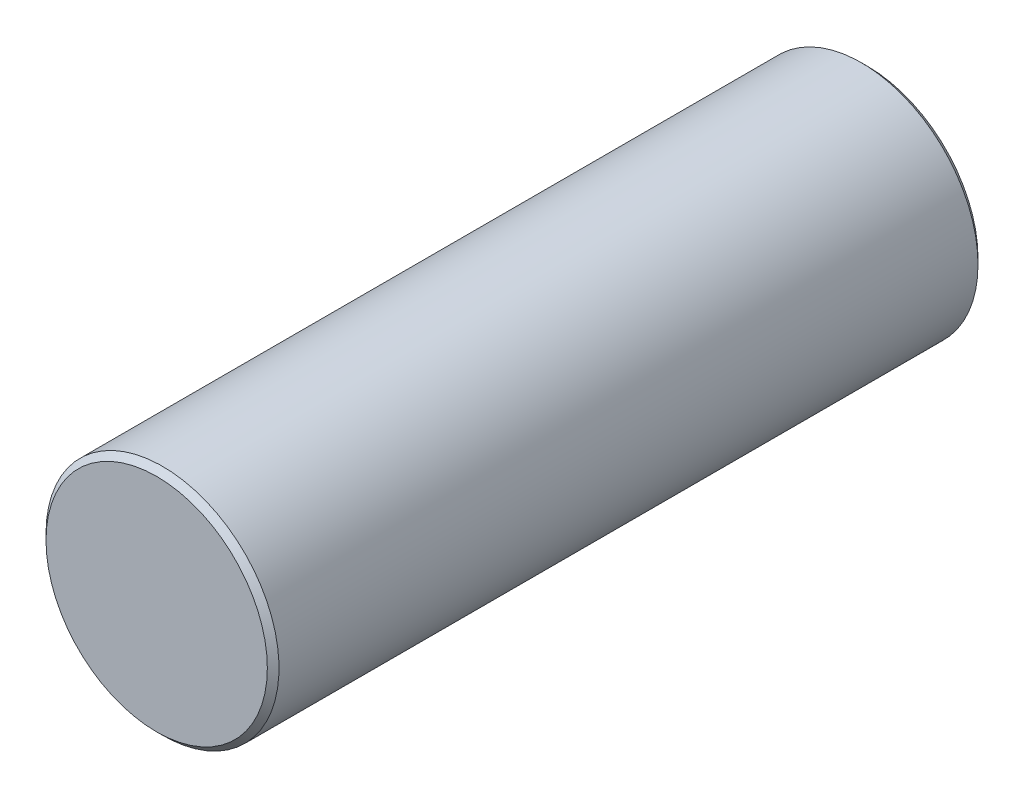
ISO-10303-21;
HEADER;
FILE_DESCRIPTION(('STEP AP214'),'2;1');
FILE_NAME('part.step','',(''),(''),'','','');
FILE_SCHEMA(('AUTOMOTIVE_DESIGN { 1 0 10303 214 1 1 1 1 }'));
ENDSEC;
DATA;
#1=APPLICATION_CONTEXT('core data for automotive mechanical design processes');
#2=APPLICATION_PROTOCOL_DEFINITION('international standard','automotive_design',2000,#1);
#3=PRODUCT_CONTEXT('',#1,'mechanical');
#4=PRODUCT('Part','Part','',(#3));
#5=PRODUCT_RELATED_PRODUCT_CATEGORY('part','',(#4));
#6=PRODUCT_DEFINITION_FORMATION('','',#4);
#7=PRODUCT_DEFINITION_CONTEXT('part definition',#1,'design');
#8=PRODUCT_DEFINITION('design','',#6,#7);
#9=PRODUCT_DEFINITION_SHAPE('','',#8);
#10=(LENGTH_UNIT() NAMED_UNIT(*) SI_UNIT(.MILLI.,.METRE.));
#11=(NAMED_UNIT(*) PLANE_ANGLE_UNIT() SI_UNIT($,.RADIAN.));
#12=(NAMED_UNIT(*) SI_UNIT($,.STERADIAN.) SOLID_ANGLE_UNIT());
#13=UNCERTAINTY_MEASURE_WITH_UNIT(LENGTH_MEASURE(1.E-05),#10,'distance_accuracy_value','');
#14=(GEOMETRIC_REPRESENTATION_CONTEXT(3) GLOBAL_UNCERTAINTY_ASSIGNED_CONTEXT((#13)) GLOBAL_UNIT_ASSIGNED_CONTEXT((#10,
#11,#12)) REPRESENTATION_CONTEXT('',''));
#15=CARTESIAN_POINT('',(0.,0.,0.));
#16=DIRECTION('',(0.,0.,1.));
#17=DIRECTION('',(1.,0.,0.));
#18=AXIS2_PLACEMENT_3D('',#15,#16,#17);
#19=CARTESIAN_POINT('',(0.,0.,30.5));
#20=DIRECTION('',(0.,0.,-1.));
#21=DIRECTION('',(-1.,0.,0.));
#22=AXIS2_PLACEMENT_3D('',#19,#20,#21);
#23=CYLINDRICAL_SURFACE('',#22,10.);
#24=CARTESIAN_POINT('',(0.,0.,-30.));
#25=DIRECTION('',(0.,0.,1.));
#26=DIRECTION('',(1.,0.,0.));
#27=AXIS2_PLACEMENT_3D('',#24,#25,#26);
#28=CIRCLE('',#27,10.);
#29=CARTESIAN_POINT('',(-10.,0.,-30.));
#30=VERTEX_POINT('',#29);
#31=EDGE_CURVE('E40',#30,#30,#28,.T.);
#32=CARTESIAN_POINT('',(0.,0.,30.));
#33=DIRECTION('',(0.,0.,1.));
#34=DIRECTION('',(1.,0.,0.));
#35=AXIS2_PLACEMENT_3D('',#32,#33,#34);
#36=CIRCLE('',#35,10.);
#37=CARTESIAN_POINT('',(-10.,0.,30.));
#38=VERTEX_POINT('',#37);
#39=EDGE_CURVE('E44',#38,#38,#36,.F.);
#40=CARTESIAN_POINT('',(-10.,0.,-30.));
#41=CARTESIAN_POINT('',(-10.,0.,-29.375));
#42=CARTESIAN_POINT('',(-10.,0.,-28.75));
#43=CARTESIAN_POINT('',(-10.,0.,-27.5));
#44=CARTESIAN_POINT('',(-10.,0.,-26.875));
#45=CARTESIAN_POINT('',(-10.,0.,-25.625));
#46=CARTESIAN_POINT('',(-10.,0.,-25.));
#47=CARTESIAN_POINT('',(-10.,0.,-23.75));
#48=CARTESIAN_POINT('',(-10.,0.,-23.125));
#49=CARTESIAN_POINT('',(-10.,0.,-21.875));
#50=CARTESIAN_POINT('',(-10.,0.,-21.25));
#51=CARTESIAN_POINT('',(-10.,0.,-20.));
#52=CARTESIAN_POINT('',(-10.,0.,-19.375));
#53=CARTESIAN_POINT('',(-10.,0.,-18.125));
#54=CARTESIAN_POINT('',(-10.,0.,-17.5));
#55=CARTESIAN_POINT('',(-10.,0.,-16.25));
#56=CARTESIAN_POINT('',(-10.,0.,-15.625));
#57=CARTESIAN_POINT('',(-10.,0.,-14.375));
#58=CARTESIAN_POINT('',(-10.,0.,-13.75));
#59=CARTESIAN_POINT('',(-10.,0.,-12.5));
#60=CARTESIAN_POINT('',(-10.,0.,-11.875));
#61=CARTESIAN_POINT('',(-10.,0.,-10.625));
#62=CARTESIAN_POINT('',(-10.,0.,-9.99999999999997));
#63=CARTESIAN_POINT('',(-10.,0.,-8.74999999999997));
#64=CARTESIAN_POINT('',(-10.,0.,-8.12499999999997));
#65=CARTESIAN_POINT('',(-10.,0.,-6.87499999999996));
#66=CARTESIAN_POINT('',(-10.,0.,-6.24999999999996));
#67=CARTESIAN_POINT('',(-10.,0.,-4.99999999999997));
#68=CARTESIAN_POINT('',(-10.,0.,-4.37499999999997));
#69=CARTESIAN_POINT('',(-10.,0.,-3.12499999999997));
#70=CARTESIAN_POINT('',(-10.,0.,-2.49999999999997));
#71=CARTESIAN_POINT('',(-10.,0.,-1.24999999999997));
#72=CARTESIAN_POINT('',(-10.,0.,-0.624999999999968));
#73=CARTESIAN_POINT('',(-10.,0.,0.625000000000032));
#74=CARTESIAN_POINT('',(-10.,0.,1.25000000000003));
#75=CARTESIAN_POINT('',(-10.,0.,2.50000000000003));
#76=CARTESIAN_POINT('',(-10.,0.,3.12500000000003));
#77=CARTESIAN_POINT('',(-10.,0.,4.37500000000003));
#78=CARTESIAN_POINT('',(-10.,0.,5.00000000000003));
#79=CARTESIAN_POINT('',(-10.,0.,6.25000000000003));
#80=CARTESIAN_POINT('',(-10.,0.,6.87500000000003));
#81=CARTESIAN_POINT('',(-10.,0.,8.12500000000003));
#82=CARTESIAN_POINT('',(-10.,0.,8.75000000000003));
#83=CARTESIAN_POINT('',(-10.,0.,10.));
#84=CARTESIAN_POINT('',(-10.,0.,10.625));
#85=CARTESIAN_POINT('',(-10.,0.,11.875));
#86=CARTESIAN_POINT('',(-10.,0.,12.5));
#87=CARTESIAN_POINT('',(-10.,0.,13.75));
#88=CARTESIAN_POINT('',(-10.,0.,14.375));
#89=CARTESIAN_POINT('',(-10.,0.,15.625));
#90=CARTESIAN_POINT('',(-10.,0.,16.25));
#91=CARTESIAN_POINT('',(-10.,0.,17.5));
#92=CARTESIAN_POINT('',(-10.,0.,18.125));
#93=CARTESIAN_POINT('',(-10.,0.,19.375));
#94=CARTESIAN_POINT('',(-10.,0.,20.));
#95=CARTESIAN_POINT('',(-10.,0.,21.25));
#96=CARTESIAN_POINT('',(-10.,0.,21.875));
#97=CARTESIAN_POINT('',(-10.,0.,23.125));
#98=CARTESIAN_POINT('',(-10.,0.,23.75));
#99=CARTESIAN_POINT('',(-10.,0.,25.));
#100=CARTESIAN_POINT('',(-10.,0.,25.625));
#101=CARTESIAN_POINT('',(-10.,0.,26.875));
#102=CARTESIAN_POINT('',(-10.,0.,27.5));
#103=CARTESIAN_POINT('',(-10.,0.,28.75));
#104=CARTESIAN_POINT('',(-10.,0.,29.375));
#105=CARTESIAN_POINT('',(-10.,0.,30.));
#106=B_SPLINE_CURVE_WITH_KNOTS('',3,(#40,#41,#42,#43,#44,#45,#46,#47,#48,#49,#50,#51,#52,#53,
#54,#55,#56,#57,#58,#59,#60,#61,#62,#63,#64,#65,#66,#67,#68,#69,#70,#71,#72,#73,#74,#75,#76,#77,
#78,#79,#80,#81,#82,#83,#84,#85,#86,#87,#88,#89,#90,#91,#92,#93,#94,#95,#96,#97,#98,#99,#100,
#101,#102,#103,#104,#105),.UNSPECIFIED.,.F.,.F.,(4,2,2,2,2,2,2,2,2,2,2,2,2,2,2,2,2,2,2,2,2,2,2,
2,2,2,2,2,2,2,2,2,4),(0.,1.875,3.75,5.625,7.5,9.375,11.25,13.125,15.,16.875,18.75,20.625,22.5,
24.375,26.25,28.125,30.,31.875,33.75,35.625,37.5,39.375,41.25,43.125,45.,46.875,48.75,50.625,
52.5,54.375,56.25,58.125,60.),.UNSPECIFIED.);
#107=EDGE_CURVE('BSEAM29',#30,#38,#106,.T.);
#108=ORIENTED_EDGE('',*,*,#31,.T.);
#109=ORIENTED_EDGE('',*,*,#39,.T.);
#110=ORIENTED_EDGE('',*,*,#107,.T.);
#111=ORIENTED_EDGE('',*,*,#107,.F.);
#112=EDGE_LOOP('',(#108,#110,#109,#111));
#113=FACE_BOUND('',#112,.T.);
#114=ADVANCED_FACE('F29',(#113),#23,.T.);
#115=CARTESIAN_POINT('',(0.,0.,30.5));
#116=DIRECTION('',(0.,0.,1.));
#117=DIRECTION('',(1.,0.,0.));
#118=AXIS2_PLACEMENT_3D('',#115,#116,#117);
#119=PLANE('',#118);
#120=CARTESIAN_POINT('',(0.,0.,30.5));
#121=DIRECTION('',(0.,0.,1.));
#122=DIRECTION('',(1.,0.,0.));
#123=AXIS2_PLACEMENT_3D('',#120,#121,#122);
#124=CIRCLE('',#123,9.50000000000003);
#125=CARTESIAN_POINT('',(9.50000000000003,0.,30.5));
#126=VERTEX_POINT('',#125);
#127=EDGE_CURVE('E10',#126,#126,#124,.T.);
#128=ORIENTED_EDGE('',*,*,#127,.T.);
#129=EDGE_LOOP('',(#128));
#130=FACE_BOUND('',#129,.T.);
#131=ADVANCED_FACE('F60',(#130),#119,.T.);
#132=CARTESIAN_POINT('',(0.,0.,-30.5));
#133=DIRECTION('',(0.,0.,1.));
#134=DIRECTION('',(1.,0.,0.));
#135=AXIS2_PLACEMENT_3D('',#132,#133,#134);
#136=PLANE('',#135);
#137=CARTESIAN_POINT('',(0.,0.,-30.5));
#138=DIRECTION('',(0.,0.,1.));
#139=DIRECTION('',(1.,0.,0.));
#140=AXIS2_PLACEMENT_3D('',#137,#138,#139);
#141=CIRCLE('',#140,9.49999999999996);
#142=CARTESIAN_POINT('',(9.49999999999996,0.,-30.5));
#143=VERTEX_POINT('',#142);
#144=EDGE_CURVE('E36',#143,#143,#141,.F.);
#145=ORIENTED_EDGE('',*,*,#144,.T.);
#146=EDGE_LOOP('',(#145));
#147=FACE_BOUND('',#146,.T.);
#148=ADVANCED_FACE('F57',(#147),#136,.F.);
#149=CARTESIAN_POINT('',(0.,0.,-30.));
#150=DIRECTION('',(0.,0.,1.));
#151=DIRECTION('',(1.,0.,0.));
#152=AXIS2_PLACEMENT_3D('',#149,#150,#151);
#153=CONICAL_SURFACE('',#152,10.,0.785398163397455);
#154=ORIENTED_EDGE('',*,*,#144,.F.);
#155=EDGE_LOOP('',(#154));
#156=FACE_BOUND('',#155,.T.);
#157=ORIENTED_EDGE('',*,*,#31,.F.);
#158=EDGE_LOOP('',(#157));
#159=FACE_BOUND('',#158,.T.);
#160=ADVANCED_FACE('F53',(#156,#159),#153,.T.);
#161=CARTESIAN_POINT('',(0.,0.,30.5));
#162=DIRECTION('',(0.,0.,-1.));
#163=DIRECTION('',(-1.,0.,0.));
#164=AXIS2_PLACEMENT_3D('',#161,#162,#163);
#165=CONICAL_SURFACE('',#164,9.50000000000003,0.785398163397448);
#166=ORIENTED_EDGE('',*,*,#39,.F.);
#167=EDGE_LOOP('',(#166));
#168=FACE_BOUND('',#167,.T.);
#169=ORIENTED_EDGE('',*,*,#127,.F.);
#170=EDGE_LOOP('',(#169));
#171=FACE_BOUND('',#170,.T.);
#172=ADVANCED_FACE('F31',(#168,#171),#165,.T.);
#173=CLOSED_SHELL('',(#114,#131,#148,#160,#172));
#174=MANIFOLD_SOLID_BREP('B2',#173);
#175=ADVANCED_BREP_SHAPE_REPRESENTATION('',(#18,#174),#14);
#176=SHAPE_DEFINITION_REPRESENTATION(#9,#175);
ENDSEC;
END-ISO-10303-21;
